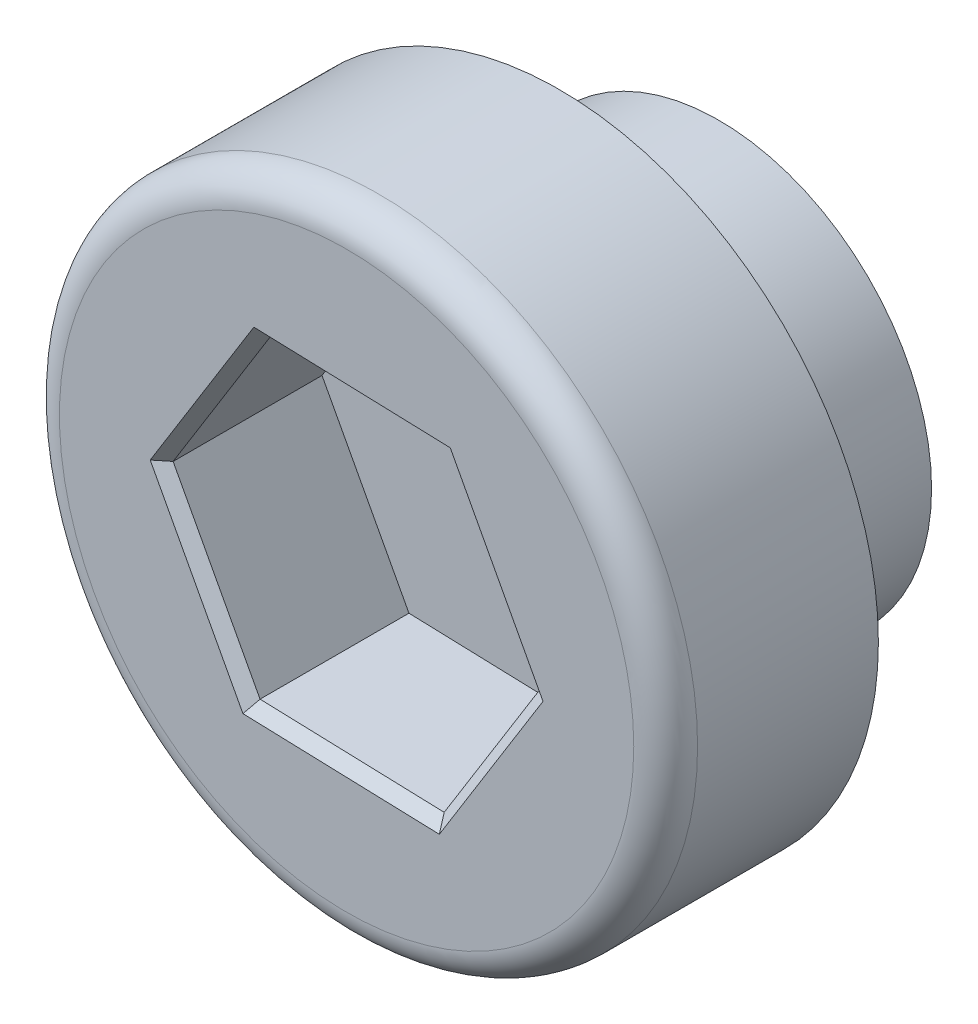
from build123d import *

# Parameters (mm, degrees)
SZKIC1_R                    = 4
DODANIE_WYCI_GNI_CIE1_DEPTH = 3
SZKIC2_R                    = 6
DODANIE_WYCI_GNI_CIE2_DEPTH = 4
WYTNIJ_WYCI_GNI_CIE1_DEPTH  = 3
ZAOKR_GLENIE1_R             = 0.6
SFAZOWANIE1_SIZE            = 0.2


with BuildPart() as part:
    # Szkic1 → Dodanie-wyci_gni_cie1 (new body)
    with BuildSketch(Plane.XY):
        Circle(SZKIC1_R)
    extrude(amount=DODANIE_WYCI_GNI_CIE1_DEPTH)

    # Szkic2 → Dodanie-wyci_gni_cie2 (add)
    with BuildSketch(Plane.XY.offset(3)):
        Circle(SZKIC2_R)
    extrude(amount=DODANIE_WYCI_GNI_CIE2_DEPTH)

    # Szkic3 → Wytnij-wyci_gni_cie1 (cut)
    with BuildSketch(Plane.XY.offset(7)):
        Polygon((-1.634875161, 3.054043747), (-3.46231705, 0.111178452), (-1.827441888, -2.942865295), (1.634875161, -3.054043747), (3.46231705, -0.111178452), (1.827441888, 2.942865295), align=None)
    extrude(amount=-WYTNIJ_WYCI_GNI_CIE1_DEPTH, mode=Mode.SUBTRACT)

    # Zaokr_glenie1
    zaokr_glenie1_edges = [part.edges().sort_by_distance(p)[0] for p in [
        (-6, 0, 7),
    ]]
    fillet(zaokr_glenie1_edges, radius=ZAOKR_GLENIE1_R)

    # Sfazowanie1
    sfazowanie1_edges = [part.edges().sort_by_distance(p)[0] for p in [
        (0.096283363, 2.998454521, 7),
        (-2.548596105, 1.582611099, 7),
        (-2.644879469, -1.415843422, 7),
        (-0.096283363, -2.998454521, 7),
        (2.548596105, -1.582611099, 7),
        (2.644879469, 1.415843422, 7),
    ]]
    chamfer(sfazowanie1_edges, length=SFAZOWANIE1_SIZE)


solid = part.part
